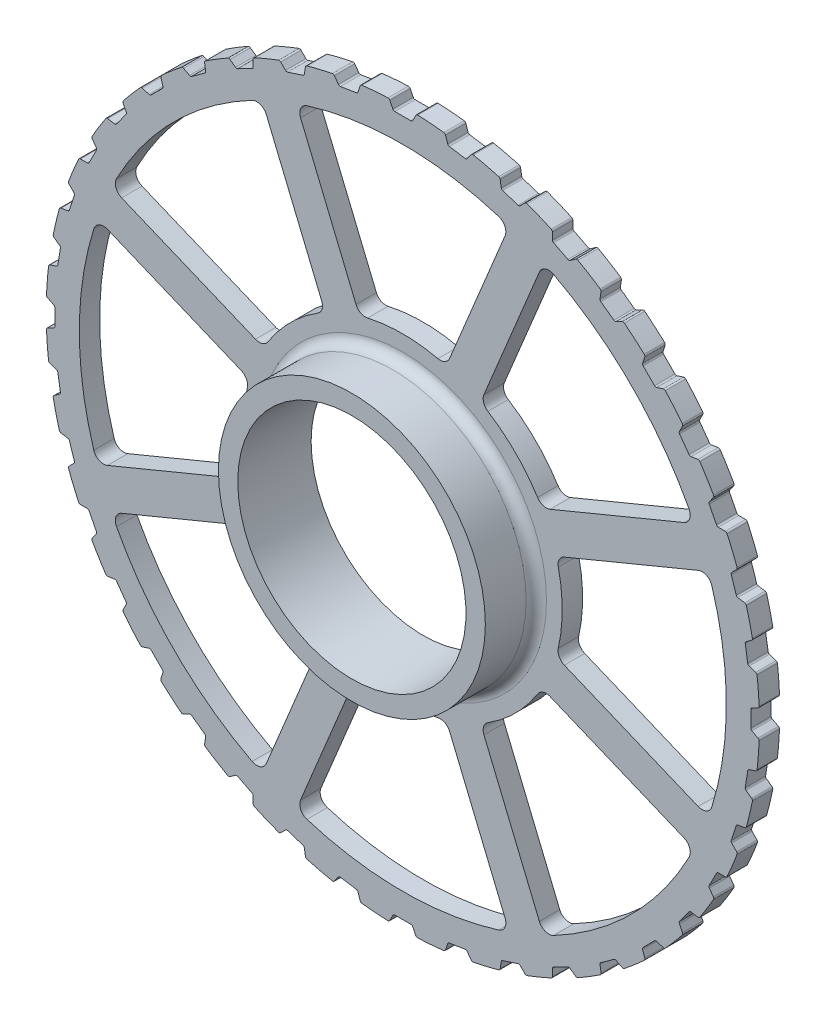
from build123d import *

# Parameters (mm, degrees)
ESQUISSE1_R                        = 35
ESQUISSE1_R_2                      = 11.1
BOSS_EXTRU_1_DEPTH                 = 2
ESQUISSE2_R                        = 13.1
ESQUISSE2_R_2                      = 11.1
BOSS_EXTRU_2_DEPTH                 = 5
ENL_V_START                        = -5
ENL_V_MAT_EXTRU_1_DEPTH            = 5
CONG_1_R                           = 0.2
R_P_TITION_CIRCULAIRE1_COUNT       = 40
CONG_1_OF_R_P_TITION_CIRCULAIRE1_R = 0.2
CONG_2_R                           = 1
ENL_V_MAT_EXTRU_2_DEPTH            = 5
CONG_3_R                           = 1
R_P_TITION_CIRCULAIRE2_COUNT       = 8
CONG_3_OF_R_P_TITION_CIRCULAIRE2_R = 1
ESQUISSE5_R                        = 11.491847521
BOSS_EXTRU_3_DEPTH                 = 7


with BuildPart() as part:
    # Esquisse1 → Boss.-Extru.1 (new body)
    with BuildSketch(Plane.XY):
        Circle(ESQUISSE1_R)
        Circle(ESQUISSE1_R_2, mode=Mode.SUBTRACT)
    extrude(amount=BOSS_EXTRU_1_DEPTH)

    # Esquisse2 → Boss.-Extru.2 (add)
    with BuildSketch(Plane.XY.offset(2)):
        Circle(ESQUISSE2_R)
        Circle(ESQUISSE2_R_2, mode=Mode.SUBTRACT)
    extrude(amount=BOSS_EXTRU_2_DEPTH)

    # Esquisse3 → Enl_v. mat.-Extru.1 (cut)
    with BuildSketch(Plane.XY.offset(2).offset(ENL_V_START)):
        with BuildLine():
            Line((-1.337838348, 34.974421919), (-0.913317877, 34.150142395))
            Line((-0.913317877, 34.150142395), (0.913317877, 34.150142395))
            Line((0.913317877, 34.150142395), (1.337838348, 34.974421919))
            ThreePointArc((1.337838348, 34.974421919), (0, 35), (-1.337838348, 34.974421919))
        make_face()
    enl_v_mat_extru_1 = extrude(amount=ENL_V_MAT_EXTRU_1_DEPTH, mode=Mode.SUBTRACT)

    # Cong_1
    cong_1_edges = [part.edges().sort_by_distance(p)[0] for p in [
        (-1.337838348, 34.974421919, 1),
        (1.337838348, 34.974421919, 1),
        (0.913317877, 34.150142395, 1),
        (-0.913317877, 34.150142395, 1),
    ]]
    fillet(cong_1_edges, radius=CONG_1_R)

    # R_p_tition circulaire1: Enl_v. mat.-Extru.1 ×40 about axis
    r_p_tition_circulaire1_axis = Axis((0, 0, 0), (0, 0, 1))
    for i in range(1, R_P_TITION_CIRCULAIRE1_COUNT):
        add(enl_v_mat_extru_1.rotate(r_p_tition_circulaire1_axis, i * 360 / R_P_TITION_CIRCULAIRE1_COUNT), mode=Mode.SUBTRACT)

    # Cong_1 of R_p_tition circulaire1
    cong_1_of_r_p_tition_circulaire1_edges = [part.edges().sort_by_distance(p)[0] for p in [
        (-6.792572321, 34.334544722, 1),
        (-4.149837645, 34.753112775, 1),
        (-4.440185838, 33.872571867, 1),
        (-6.244332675, 33.58682308, 1),
        (-12.08005062, 32.849237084, 1),
        (-9.535330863, 33.676066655, 1),
        (-9.684357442, 32.760946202, 1),
        (-11.421591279, 32.196484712, 1),
        (-17.070077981, 30.555072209, 1),
        (-14.686032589, 31.769804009, 1),
        (-14.690068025, 30.842637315, 1),
        (-16.317612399, 30.013362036, 1),
        (-21.63978337, 27.50854005, 1),
        (-19.475115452, 29.081263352, 1),
        (-19.33406038, 28.164880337, 1),
        (-20.811839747, 27.091210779, 1),
        (-25.676645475, 23.784656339, 1),
        (-23.784656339, 25.676645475, 1),
        (-23.501984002, 24.79361053, 1),
        (-24.79361053, 23.501984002, 1),
        (-29.081263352, 19.475115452, 1),
        (-27.50854005, 21.63978337, 1),
        (-27.091210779, 20.811839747, 1),
        (-28.164880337, 19.33406038, 1),
        (-31.769804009, 14.686032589, 1),
        (-30.555072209, 17.070077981, 1),
        (-30.013362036, 16.317612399, 1),
        (-30.842637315, 14.690068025, 1),
        (-33.676066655, 9.535330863, 1),
        (-32.849237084, 12.08005062, 1),
        (-32.196484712, 11.421591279, 1),
        (-32.760946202, 9.684357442, 1),
        (-34.753112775, 4.149837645, 1),
        (-34.334544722, 6.792572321, 1),
        (-33.58682308, 6.244332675, 1),
        (-33.872571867, 4.440185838, 1),
        (-34.974421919, -1.337838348, 1),
        (-34.974421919, 1.337838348, 1),
        (-34.150142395, 0.913317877, 1),
        (-34.150142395, -0.913317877, 1),
        (-34.334544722, -6.792572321, 1),
        (-34.753112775, -4.149837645, 1),
        (-33.872571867, -4.440185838, 1),
        (-33.58682308, -6.244332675, 1),
        (-32.849237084, -12.08005062, 1),
        (-33.676066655, -9.535330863, 1),
        (-32.760946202, -9.684357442, 1),
        (-32.196484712, -11.421591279, 1),
        (-30.555072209, -17.070077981, 1),
        (-31.769804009, -14.686032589, 1),
        (-30.842637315, -14.690068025, 1),
        (-30.013362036, -16.317612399, 1),
        (-27.50854005, -21.63978337, 1),
        (-29.081263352, -19.475115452, 1),
        (-28.164880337, -19.33406038, 1),
        (-27.091210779, -20.811839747, 1),
        (-23.784656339, -25.676645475, 1),
        (-25.676645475, -23.784656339, 1),
        (-24.79361053, -23.501984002, 1),
        (-23.501984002, -24.79361053, 1),
        (-19.475115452, -29.081263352, 1),
        (-21.63978337, -27.50854005, 1),
        (-20.811839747, -27.091210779, 1),
        (-19.33406038, -28.164880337, 1),
        (-14.686032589, -31.769804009, 1),
        (-17.070077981, -30.555072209, 1),
        (-16.317612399, -30.013362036, 1),
        (-14.690068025, -30.842637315, 1),
        (-9.535330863, -33.676066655, 1),
        (-12.08005062, -32.849237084, 1),
        (-11.421591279, -32.196484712, 1),
        (-9.684357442, -32.760946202, 1),
        (-4.149837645, -34.753112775, 1),
        (-6.792572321, -34.334544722, 1),
        (-6.244332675, -33.58682308, 1),
        (-4.440185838, -33.872571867, 1),
        (1.337838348, -34.974421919, 1),
        (-1.337838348, -34.974421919, 1),
        (-0.913317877, -34.150142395, 1),
        (0.913317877, -34.150142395, 1),
        (6.792572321, -34.334544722, 1),
        (4.149837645, -34.753112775, 1),
        (4.440185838, -33.872571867, 1),
        (6.244332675, -33.58682308, 1),
        (12.08005062, -32.849237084, 1),
        (9.535330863, -33.676066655, 1),
        (9.684357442, -32.760946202, 1),
        (11.421591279, -32.196484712, 1),
        (17.070077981, -30.555072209, 1),
        (14.686032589, -31.769804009, 1),
        (14.690068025, -30.842637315, 1),
        (16.317612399, -30.013362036, 1),
        (21.63978337, -27.50854005, 1),
        (19.475115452, -29.081263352, 1),
        (19.33406038, -28.164880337, 1),
        (20.811839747, -27.091210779, 1),
        (25.676645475, -23.784656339, 1),
        (23.784656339, -25.676645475, 1),
        (23.501984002, -24.79361053, 1),
        (24.79361053, -23.501984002, 1),
        (29.081263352, -19.475115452, 1),
        (27.50854005, -21.63978337, 1),
        (27.091210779, -20.811839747, 1),
        (28.164880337, -19.33406038, 1),
        (31.769804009, -14.686032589, 1),
        (30.555072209, -17.070077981, 1),
        (30.013362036, -16.317612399, 1),
        (30.842637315, -14.690068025, 1),
        (33.676066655, -9.535330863, 1),
        (32.849237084, -12.08005062, 1),
        (32.196484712, -11.421591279, 1),
        (32.760946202, -9.684357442, 1),
        (34.753112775, -4.149837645, 1),
        (34.334544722, -6.792572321, 1),
        (33.58682308, -6.244332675, 1),
        (33.872571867, -4.440185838, 1),
        (34.974421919, 1.337838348, 1),
        (34.974421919, -1.337838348, 1),
        (34.150142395, -0.913317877, 1),
        (34.150142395, 0.913317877, 1),
        (34.334544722, 6.792572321, 1),
        (34.753112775, 4.149837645, 1),
        (33.872571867, 4.440185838, 1),
        (33.58682308, 6.244332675, 1),
        (32.849237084, 12.08005062, 1),
        (33.676066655, 9.535330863, 1),
        (32.760946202, 9.684357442, 1),
        (32.196484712, 11.421591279, 1),
        (30.555072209, 17.070077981, 1),
        (31.769804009, 14.686032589, 1),
        (30.842637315, 14.690068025, 1),
        (30.013362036, 16.317612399, 1),
        (27.50854005, 21.63978337, 1),
        (29.081263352, 19.475115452, 1),
        (28.164880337, 19.33406038, 1),
        (27.091210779, 20.811839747, 1),
        (23.784656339, 25.676645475, 1),
        (25.676645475, 23.784656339, 1),
        (24.79361053, 23.501984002, 1),
        (23.501984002, 24.79361053, 1),
        (19.475115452, 29.081263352, 1),
        (21.63978337, 27.50854005, 1),
        (20.811839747, 27.091210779, 1),
        (19.33406038, 28.164880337, 1),
        (14.686032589, 31.769804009, 1),
        (17.070077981, 30.555072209, 1),
        (16.317612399, 30.013362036, 1),
        (14.690068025, 30.842637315, 1),
        (9.535330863, 33.676066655, 1),
        (12.08005062, 32.849237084, 1),
        (11.421591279, 32.196484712, 1),
        (9.684357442, 32.760946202, 1),
        (4.149837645, 34.753112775, 1),
        (6.792572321, 34.334544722, 1),
        (6.244332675, 33.58682308, 1),
        (4.440185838, 33.872571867, 1),
    ]]
    fillet(cong_1_of_r_p_tition_circulaire1_edges, radius=CONG_1_OF_R_P_TITION_CIRCULAIRE1_R)

    # Cong_2
    cong_2_edges = [part.edges().sort_by_distance(p)[0] for p in [
        (-13.1, 0, 2),
    ]]
    fillet(cong_2_edges, radius=CONG_2_R)

    # Esquisse4 → Enl_v. mat.-Extru.2 (cut)
    with BuildSketch(Plane.XY.offset(2)):
        with BuildLine():
            Line((-10.44784324, 29.985327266), (-4.263061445, 15.053943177))
            ThreePointArc((-4.263061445, 15.053943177), (0, 15.645922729), (4.263061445, 15.053943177))
            Line((4.263061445, 15.053943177), (10.44784324, 29.985327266))
            ThreePointArc((10.44784324, 29.985327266), (0, 31.753382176), (-10.44784324, 29.985327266))
        make_face()
    enl_v_mat_extru_2 = extrude(amount=-ENL_V_MAT_EXTRU_2_DEPTH, mode=Mode.SUBTRACT)

    # Cong_3
    cong_3_edges = [part.edges().sort_by_distance(p)[0] for p in [
        (4.263061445, 15.053943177, 1),
        (-4.263061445, 15.053943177, 1),
        (-10.44784324, 29.985327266, 1),
        (10.44784324, 29.985327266, 1),
    ]]
    fillet(cong_3_edges, radius=CONG_3_R)

    # R_p_tition circulaire2: Enl_v. mat.-Extru.2 ×8 about axis
    r_p_tition_circulaire2_axis = Axis((0, 0, 0), (0, 0, 1))
    for i in range(1, R_P_TITION_CIRCULAIRE2_COUNT):
        add(enl_v_mat_extru_2.rotate(r_p_tition_circulaire2_axis, i * 360 / R_P_TITION_CIRCULAIRE2_COUNT), mode=Mode.SUBTRACT)

    # Cong_3 of R_p_tition circulaire2
    cong_3_of_r_p_tition_circulaire2_edges = [part.edges().sort_by_distance(p)[0] for p in [
        (-7.630305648, 13.65918496, 1),
        (-13.65918496, 7.630305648, 1),
        (-28.59056905, 13.815087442, 1),
        (-13.815087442, 28.59056905, 1),
        (-15.053943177, 4.263061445, 1),
        (-15.053943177, -4.263061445, 1),
        (-29.985327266, -10.44784324, 1),
        (-29.985327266, 10.44784324, 1),
        (-13.65918496, -7.630305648, 1),
        (-7.630305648, -13.65918496, 1),
        (-13.815087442, -28.59056905, 1),
        (-28.59056905, -13.815087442, 1),
        (-4.263061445, -15.053943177, 1),
        (4.263061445, -15.053943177, 1),
        (10.44784324, -29.985327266, 1),
        (-10.44784324, -29.985327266, 1),
        (7.630305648, -13.65918496, 1),
        (13.65918496, -7.630305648, 1),
        (28.59056905, -13.815087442, 1),
        (13.815087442, -28.59056905, 1),
        (15.053943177, -4.263061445, 1),
        (15.053943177, 4.263061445, 1),
        (29.985327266, 10.44784324, 1),
        (29.985327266, -10.44784324, 1),
        (13.65918496, 7.630305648, 1),
        (7.630305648, 13.65918496, 1),
        (13.815087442, 28.59056905, 1),
        (28.59056905, 13.815087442, 1),
    ]]
    fillet(cong_3_of_r_p_tition_circulaire2_edges, radius=CONG_3_OF_R_P_TITION_CIRCULAIRE2_R)

    # Esquisse5 → Boss.-Extru.3 (add)
    with BuildSketch(Plane.XY.offset(7)):
        Circle(ESQUISSE5_R)
    extrude(amount=-BOSS_EXTRU_3_DEPTH)

    # Esquisse6 → Enl_vement de mati_re-R_volution1 (revolve, cut)
    with BuildSketch(Plane(origin=(0, 0, 0), x_dir=(1, 0, 0), z_dir=(0, 1, 0))):
        Polygon((-11, 0), (-11.2, -7), (0, -7), (0, 0), align=None)
    revolve(axis=Axis((0, 0, 0), (0, 0, 1)), mode=Mode.SUBTRACT)


solid = part.part
